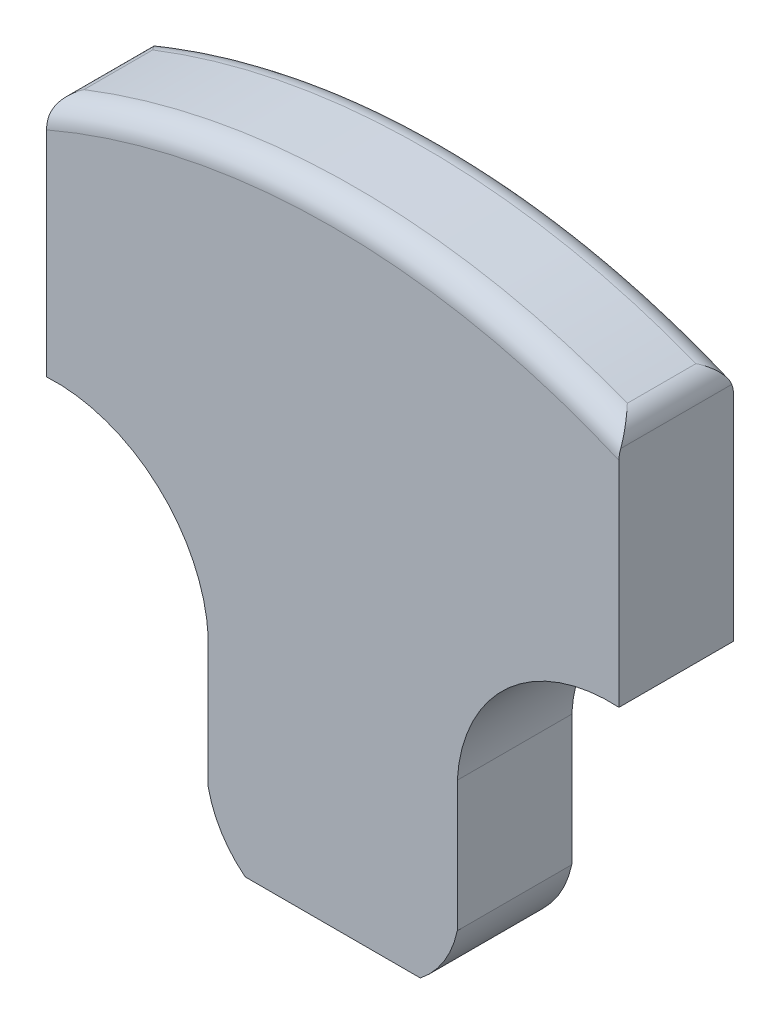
ISO-10303-21;
HEADER;
FILE_DESCRIPTION(('STEP AP214'),'2;1');
FILE_NAME('part.step','',(''),(''),'','','');
FILE_SCHEMA(('AUTOMOTIVE_DESIGN { 1 0 10303 214 1 1 1 1 }'));
ENDSEC;
DATA;
#1=APPLICATION_CONTEXT('core data for automotive mechanical design processes');
#2=APPLICATION_PROTOCOL_DEFINITION('international standard','automotive_design',2000,#1);
#3=PRODUCT_CONTEXT('',#1,'mechanical');
#4=PRODUCT('Part','Part','',(#3));
#5=PRODUCT_RELATED_PRODUCT_CATEGORY('part','',(#4));
#6=PRODUCT_DEFINITION_FORMATION('','',#4);
#7=PRODUCT_DEFINITION_CONTEXT('part definition',#1,'design');
#8=PRODUCT_DEFINITION('design','',#6,#7);
#9=PRODUCT_DEFINITION_SHAPE('','',#8);
#10=(LENGTH_UNIT() NAMED_UNIT(*) SI_UNIT(.MILLI.,.METRE.));
#11=(NAMED_UNIT(*) PLANE_ANGLE_UNIT() SI_UNIT($,.RADIAN.));
#12=(NAMED_UNIT(*) SI_UNIT($,.STERADIAN.) SOLID_ANGLE_UNIT());
#13=UNCERTAINTY_MEASURE_WITH_UNIT(LENGTH_MEASURE(1.E-05),#10,'distance_accuracy_value','');
#14=(GEOMETRIC_REPRESENTATION_CONTEXT(3) GLOBAL_UNCERTAINTY_ASSIGNED_CONTEXT((#13)) GLOBAL_UNIT_ASSIGNED_CONTEXT((#10,
#11,#12)) REPRESENTATION_CONTEXT('',''));
#15=CARTESIAN_POINT('',(0.,0.,0.));
#16=DIRECTION('',(0.,0.,1.));
#17=DIRECTION('',(1.,0.,0.));
#18=AXIS2_PLACEMENT_3D('',#15,#16,#17);
#19=CARTESIAN_POINT('',(-39.8872036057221,30.7547619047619,12.7));
#20=DIRECTION('',(1.,0.,0.));
#21=DIRECTION('',(0.,1.,0.));
#22=AXIS2_PLACEMENT_3D('',#19,#20,#21);
#23=PLANE('',#22);
#24=DIRECTION('',(0.,0.,1.));
#25=VECTOR('',#24,1.);
#26=CARTESIAN_POINT('',(-39.8872036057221,4.27019014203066,-0.190028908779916));
#27=LINE('',#26,#25);
#28=CARTESIAN_POINT('',(-39.8872036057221,4.27019014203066,0.));
#29=VERTEX_POINT('',#28);
#30=CARTESIAN_POINT('',(-39.8872036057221,4.27019014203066,12.7));
#31=VERTEX_POINT('',#30);
#32=EDGE_CURVE('E289',#29,#31,#27,.T.);
#33=ORIENTED_EDGE('',*,*,#32,.T.);
#34=DIRECTION('',(0.,-1.,0.));
#35=VECTOR('',#34,1.);
#36=CARTESIAN_POINT('',(-39.8872036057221,30.7547619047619,12.7));
#37=LINE('',#36,#35);
#38=CARTESIAN_POINT('',(-39.8872036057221,27.9974671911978,12.7));
#39=VERTEX_POINT('',#38);
#40=EDGE_CURVE('E159',#39,#31,#37,.T.);
#41=ORIENTED_EDGE('',*,*,#40,.F.);
#42=CARTESIAN_POINT('',(-39.8872036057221,27.9974671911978,12.7));
#43=CARTESIAN_POINT('',(-39.8872036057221,28.0864951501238,12.7000048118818));
#44=CARTESIAN_POINT('',(-39.8872036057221,28.1755255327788,12.6960502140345));
#45=CARTESIAN_POINT('',(-39.8872036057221,28.3521765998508,12.6803077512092));
#46=CARTESIAN_POINT('',(-39.8872036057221,28.4398028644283,12.6685824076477));
#47=CARTESIAN_POINT('',(-39.8872036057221,28.6136739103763,12.6373819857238));
#48=CARTESIAN_POINT('',(-39.8872036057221,28.6999186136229,12.6179064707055));
#49=CARTESIAN_POINT('',(-39.8872036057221,28.8709889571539,12.5710930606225));
#50=CARTESIAN_POINT('',(-39.8872036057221,28.9557976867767,12.5436934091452));
#51=CARTESIAN_POINT('',(-39.8872036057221,29.0391723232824,12.5124322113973));
#52=B_SPLINE_CURVE_WITH_KNOTS('',3,(#42,#43,#44,#45,#46,#47,#48,#49,#50,#51),.UNSPECIFIED.,.F.,
.F.,(4,2,2,2,4),(0.,0.266999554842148,0.531876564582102,0.796768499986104,1.06378321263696),.UNSPECIFIED.);
#53=CARTESIAN_POINT('',(-39.8872036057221,29.0391723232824,12.5124322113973));
#54=VERTEX_POINT('',#53);
#55=EDGE_CURVE('E154',#39,#54,#52,.T.);
#56=ORIENTED_EDGE('',*,*,#55,.T.);
#57=DIRECTION('',(0.,0.,-1.));
#58=VECTOR('',#57,1.);
#59=CARTESIAN_POINT('',(-39.8872036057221,29.0391723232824,12.7));
#60=LINE('',#59,#58);
#61=CARTESIAN_POINT('',(-39.8872036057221,29.0391723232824,0.187567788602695));
#62=VERTEX_POINT('',#61);
#63=EDGE_CURVE('E157',#54,#62,#60,.T.);
#64=ORIENTED_EDGE('',*,*,#63,.T.);
#65=CARTESIAN_POINT('',(-39.8872036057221,29.0391723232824,0.187567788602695));
#66=CARTESIAN_POINT('',(-39.8872036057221,28.9557976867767,0.156306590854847));
#67=CARTESIAN_POINT('',(-39.8872036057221,28.8709889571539,0.128906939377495));
#68=CARTESIAN_POINT('',(-39.8872036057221,28.6999186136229,0.0820935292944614));
#69=CARTESIAN_POINT('',(-39.8872036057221,28.6136739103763,0.062618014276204));
#70=CARTESIAN_POINT('',(-39.8872036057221,28.4398028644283,0.0314175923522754));
#71=CARTESIAN_POINT('',(-39.8872036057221,28.3521765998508,0.0196922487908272));
#72=CARTESIAN_POINT('',(-39.8872036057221,28.1755255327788,0.00394978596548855));
#73=CARTESIAN_POINT('',(-39.8872036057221,28.0864951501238,-4.81188178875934E-06));
#74=CARTESIAN_POINT('',(-39.8872036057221,27.9974671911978,0.));
#75=B_SPLINE_CURVE_WITH_KNOTS('',3,(#65,#66,#67,#68,#69,#70,#71,#72,#73,#74),.UNSPECIFIED.,.F.,
.F.,(4,2,2,2,4),(0.,0.26701471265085,0.531906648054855,0.796783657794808,1.06378321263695),.UNSPECIFIED.);
#76=CARTESIAN_POINT('',(-39.8872036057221,27.9974671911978,0.));
#77=VERTEX_POINT('',#76);
#78=EDGE_CURVE('E179',#62,#77,#75,.T.);
#79=ORIENTED_EDGE('',*,*,#78,.T.);
#80=DIRECTION('',(0.,-1.,0.));
#81=VECTOR('',#80,1.);
#82=CARTESIAN_POINT('',(-39.8872036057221,30.7547619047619,0.));
#83=LINE('',#82,#81);
#84=EDGE_CURVE('E305',#77,#29,#83,.T.);
#85=ORIENTED_EDGE('',*,*,#84,.T.);
#86=EDGE_LOOP('',(#33,#41,#56,#64,#79,#85));
#87=FACE_BOUND('',#86,.T.);
#88=ADVANCED_FACE('F32',(#87),#23,.F.);
#89=CARTESIAN_POINT('',(-39.8872036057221,-32.7452380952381,12.7));
#90=DIRECTION('',(0.,1.,0.));
#91=DIRECTION('',(0.,0.,1.));
#92=AXIS2_PLACEMENT_3D('',#89,#90,#91);
#93=PLANE('',#92);
#94=DIRECTION('',(1.,0.,0.));
#95=VECTOR('',#94,1.);
#96=CARTESIAN_POINT('',(-39.8872036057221,-32.7452380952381,0.));
#97=LINE('',#96,#95);
#98=CARTESIAN_POINT('',(-17.8482910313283,-32.7452380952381,0.));
#99=VERTEX_POINT('',#98);
#100=CARTESIAN_POINT('',(1.57388381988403,-32.7452380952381,0.));
#101=VERTEX_POINT('',#100);
#102=EDGE_CURVE('E309',#99,#101,#97,.T.);
#103=ORIENTED_EDGE('',*,*,#102,.T.);
#104=DIRECTION('',(0.,0.,1.));
#105=VECTOR('',#104,1.);
#106=CARTESIAN_POINT('',(1.57388381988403,-32.7452380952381,-0.190028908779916));
#107=LINE('',#106,#105);
#108=CARTESIAN_POINT('',(1.57388381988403,-32.7452380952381,12.7));
#109=VERTEX_POINT('',#108);
#110=EDGE_CURVE('E272',#101,#109,#107,.T.);
#111=ORIENTED_EDGE('',*,*,#110,.T.);
#112=DIRECTION('',(1.,0.,0.));
#113=VECTOR('',#112,1.);
#114=CARTESIAN_POINT('',(-39.8872036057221,-32.7452380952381,12.7));
#115=LINE('',#114,#113);
#116=CARTESIAN_POINT('',(-17.8482910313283,-32.7452380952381,12.7));
#117=VERTEX_POINT('',#116);
#118=EDGE_CURVE('E155',#117,#109,#115,.T.);
#119=ORIENTED_EDGE('',*,*,#118,.F.);
#120=DIRECTION('',(0.,0.,1.));
#121=VECTOR('',#120,1.);
#122=CARTESIAN_POINT('',(-17.8482910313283,-32.7452380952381,-0.190028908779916));
#123=LINE('',#122,#121);
#124=EDGE_CURVE('E287',#99,#117,#123,.T.);
#125=ORIENTED_EDGE('',*,*,#124,.F.);
#126=EDGE_LOOP('',(#103,#111,#119,#125));
#127=FACE_BOUND('',#126,.T.);
#128=ADVANCED_FACE('F175',(#127),#93,.F.);
#129=CARTESIAN_POINT('',(-8.13720360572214,-45.8013678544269,12.7));
#130=DIRECTION('',(0.,0.,-1.));
#131=DIRECTION('',(-1.,0.,0.));
#132=AXIS2_PLACEMENT_3D('',#129,#130,#131);
#133=PLANE('',#132);
#134=ORIENTED_EDGE('',*,*,#118,.T.);
#135=CARTESIAN_POINT('',(-5.4005173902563,-23.834333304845,12.7));
#136=DIRECTION('',(0.,0.,1.));
#137=DIRECTION('',(1.,0.,0.));
#138=AXIS2_PLACEMENT_3D('',#135,#136,#137);
#139=CIRCLE('',#138,11.3157631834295);
#140=CARTESIAN_POINT('',(5.67412073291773,-26.1578837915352,12.7));
#141=VERTEX_POINT('',#140);
#142=EDGE_CURVE('E268',#141,#109,#139,.F.);
#143=ORIENTED_EDGE('',*,*,#142,.F.);
#144=DIRECTION('',(0.,-1.,0.));
#145=VECTOR('',#144,1.);
#146=CARTESIAN_POINT('',(5.67412073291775,-71.205876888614,12.7));
#147=LINE('',#146,#145);
#148=CARTESIAN_POINT('',(5.67412073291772,-11.6991536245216,12.7));
#149=VERTEX_POINT('',#148);
#150=EDGE_CURVE('E148',#149,#141,#147,.T.);
#151=ORIENTED_EDGE('',*,*,#150,.F.);
#152=CARTESIAN_POINT('',(22.628130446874,-12.6838195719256,12.7));
#153=DIRECTION('',(0.,0.,1.));
#154=DIRECTION('',(1.,0.,0.));
#155=AXIS2_PLACEMENT_3D('',#152,#153,#154);
#156=CIRCLE('',#155,16.9825796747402);
#157=CARTESIAN_POINT('',(23.6127963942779,4.27019014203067,12.7));
#158=VERTEX_POINT('',#157);
#159=EDGE_CURVE('E134',#158,#149,#156,.T.);
#160=ORIENTED_EDGE('',*,*,#159,.F.);
#161=DIRECTION('',(0.,1.,0.));
#162=VECTOR('',#161,1.);
#163=CARTESIAN_POINT('',(23.6127963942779,30.7547619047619,12.7));
#164=LINE('',#163,#162);
#165=CARTESIAN_POINT('',(23.6127963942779,27.9974671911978,12.7));
#166=VERTEX_POINT('',#165);
#167=EDGE_CURVE('E144',#158,#166,#164,.T.);
#168=ORIENTED_EDGE('',*,*,#167,.T.);
#169=CARTESIAN_POINT('',(-8.13720360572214,-45.8013678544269,12.7));
#170=DIRECTION('',(0.,0.,-1.));
#171=DIRECTION('',(-1.,0.,0.));
#172=AXIS2_PLACEMENT_3D('',#169,#170,#171);
#173=CIRCLE('',#172,80.3388483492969);
#174=EDGE_CURVE('E252',#166,#39,#173,.F.);
#175=ORIENTED_EDGE('',*,*,#174,.T.);
#176=ORIENTED_EDGE('',*,*,#40,.T.);
#177=CARTESIAN_POINT('',(-38.9025376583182,-12.6838195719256,12.7));
#178=DIRECTION('',(0.,0.,1.));
#179=DIRECTION('',(1.,0.,0.));
#180=AXIS2_PLACEMENT_3D('',#177,#178,#179);
#181=CIRCLE('',#180,16.9825796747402);
#182=CARTESIAN_POINT('',(-21.948527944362,-11.6991536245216,12.7));
#183=VERTEX_POINT('',#182);
#184=EDGE_CURVE('E283',#31,#183,#181,.F.);
#185=ORIENTED_EDGE('',*,*,#184,.T.);
#186=DIRECTION('',(0.,-1.,0.));
#187=VECTOR('',#186,1.);
#188=CARTESIAN_POINT('',(-21.948527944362,-71.205876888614,12.7));
#189=LINE('',#188,#187);
#190=CARTESIAN_POINT('',(-21.948527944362,-26.1578837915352,12.7));
#191=VERTEX_POINT('',#190);
#192=EDGE_CURVE('E275',#183,#191,#189,.T.);
#193=ORIENTED_EDGE('',*,*,#192,.T.);
#194=CARTESIAN_POINT('',(-10.8738898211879,-23.834333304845,12.7));
#195=DIRECTION('',(0.,0.,1.));
#196=DIRECTION('',(1.,0.,0.));
#197=AXIS2_PLACEMENT_3D('',#194,#195,#196);
#198=CIRCLE('',#197,11.3157631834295);
#199=EDGE_CURVE('E271',#191,#117,#198,.T.);
#200=ORIENTED_EDGE('',*,*,#199,.T.);
#201=EDGE_LOOP('',(#134,#143,#151,#160,#168,#175,#176,#185,#193,#200));
#202=FACE_BOUND('',#201,.T.);
#203=ADVANCED_FACE('F143',(#202),#133,.F.);
#204=CARTESIAN_POINT('',(-8.13720360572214,-45.8013678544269,0.));
#205=DIRECTION('',(0.,0.,-1.));
#206=DIRECTION('',(-1.,0.,0.));
#207=AXIS2_PLACEMENT_3D('',#204,#205,#206);
#208=PLANE('',#207);
#209=CARTESIAN_POINT('',(-5.4005173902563,-23.834333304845,0.));
#210=DIRECTION('',(0.,0.,-1.));
#211=DIRECTION('',(-1.,0.,0.));
#212=AXIS2_PLACEMENT_3D('',#209,#210,#211);
#213=CIRCLE('',#212,11.3157631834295);
#214=CARTESIAN_POINT('',(5.67412073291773,-26.1578837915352,0.));
#215=VERTEX_POINT('',#214);
#216=EDGE_CURVE('E11',#101,#215,#213,.F.);
#217=ORIENTED_EDGE('',*,*,#216,.F.);
#218=ORIENTED_EDGE('',*,*,#102,.F.);
#219=CARTESIAN_POINT('',(-10.8738898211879,-23.834333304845,0.));
#220=DIRECTION('',(0.,0.,-1.));
#221=DIRECTION('',(-1.,0.,0.));
#222=AXIS2_PLACEMENT_3D('',#219,#220,#221);
#223=CIRCLE('',#222,11.3157631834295);
#224=CARTESIAN_POINT('',(-21.948527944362,-26.1578837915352,0.));
#225=VERTEX_POINT('',#224);
#226=EDGE_CURVE('E139',#99,#225,#223,.T.);
#227=ORIENTED_EDGE('',*,*,#226,.T.);
#228=DIRECTION('',(0.,1.,0.));
#229=VECTOR('',#228,1.);
#230=CARTESIAN_POINT('',(-21.948527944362,-45.8013678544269,0.));
#231=LINE('',#230,#229);
#232=CARTESIAN_POINT('',(-21.948527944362,-11.6991536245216,0.));
#233=VERTEX_POINT('',#232);
#234=EDGE_CURVE('E254',#225,#233,#231,.T.);
#235=ORIENTED_EDGE('',*,*,#234,.T.);
#236=CARTESIAN_POINT('',(-38.9025376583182,-12.6838195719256,0.));
#237=DIRECTION('',(0.,0.,-1.));
#238=DIRECTION('',(-1.,0.,0.));
#239=AXIS2_PLACEMENT_3D('',#236,#237,#238);
#240=CIRCLE('',#239,16.9825796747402);
#241=EDGE_CURVE('E257',#233,#29,#240,.F.);
#242=ORIENTED_EDGE('',*,*,#241,.T.);
#243=ORIENTED_EDGE('',*,*,#84,.F.);
#244=CARTESIAN_POINT('',(-8.13720360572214,-45.8013678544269,0.));
#245=DIRECTION('',(0.,0.,-1.));
#246=DIRECTION('',(-1.,0.,0.));
#247=AXIS2_PLACEMENT_3D('',#244,#245,#246);
#248=CIRCLE('',#247,80.3388483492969);
#249=CARTESIAN_POINT('',(23.6127963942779,27.9974671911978,0.));
#250=VERTEX_POINT('',#249);
#251=EDGE_CURVE('E248',#77,#250,#248,.T.);
#252=ORIENTED_EDGE('',*,*,#251,.T.);
#253=DIRECTION('',(0.,1.,0.));
#254=VECTOR('',#253,1.);
#255=CARTESIAN_POINT('',(23.6127963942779,30.7547619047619,0.));
#256=LINE('',#255,#254);
#257=CARTESIAN_POINT('',(23.6127963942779,4.27019014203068,0.));
#258=VERTEX_POINT('',#257);
#259=EDGE_CURVE('E270',#258,#250,#256,.T.);
#260=ORIENTED_EDGE('',*,*,#259,.F.);
#261=CARTESIAN_POINT('',(22.628130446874,-12.6838195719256,0.));
#262=DIRECTION('',(0.,0.,-1.));
#263=DIRECTION('',(-1.,0.,0.));
#264=AXIS2_PLACEMENT_3D('',#261,#262,#263);
#265=CIRCLE('',#264,16.9825796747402);
#266=CARTESIAN_POINT('',(5.67412073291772,-11.6991536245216,0.));
#267=VERTEX_POINT('',#266);
#268=EDGE_CURVE('E47',#267,#258,#265,.T.);
#269=ORIENTED_EDGE('',*,*,#268,.F.);
#270=DIRECTION('',(0.,1.,0.));
#271=VECTOR('',#270,1.);
#272=CARTESIAN_POINT('',(5.67412073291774,-45.8013678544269,0.));
#273=LINE('',#272,#271);
#274=EDGE_CURVE('E40',#215,#267,#273,.T.);
#275=ORIENTED_EDGE('',*,*,#274,.F.);
#276=EDGE_LOOP('',(#217,#218,#227,#235,#242,#243,#252,#260,#269,#275));
#277=FACE_BOUND('',#276,.T.);
#278=ADVANCED_FACE('F228',(#277),#208,.T.);
#279=CARTESIAN_POINT('',(-8.13720360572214,-45.8013678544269,12.7));
#280=DIRECTION('',(0.,0.,-1.));
#281=DIRECTION('',(-1.,0.,0.));
#282=AXIS2_PLACEMENT_3D('',#279,#280,#281);
#283=CYLINDRICAL_SURFACE('',#282,82.8788483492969);
#284=DIRECTION('',(0.,0.,-1.));
#285=VECTOR('',#284,1.);
#286=CARTESIAN_POINT('',(21.9963022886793,31.4053373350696,12.7));
#287=LINE('',#286,#285);
#288=CARTESIAN_POINT('',(21.9963022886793,31.4053373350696,10.16));
#289=VERTEX_POINT('',#288);
#290=CARTESIAN_POINT('',(21.9963022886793,31.4053373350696,2.54));
#291=VERTEX_POINT('',#290);
#292=EDGE_CURVE('E322',#289,#291,#287,.T.);
#293=ORIENTED_EDGE('',*,*,#292,.T.);
#294=CARTESIAN_POINT('',(-8.13720360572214,-45.8013678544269,2.54));
#295=DIRECTION('',(0.,0.,-1.));
#296=DIRECTION('',(-1.,0.,0.));
#297=AXIS2_PLACEMENT_3D('',#294,#295,#296);
#298=CIRCLE('',#297,82.8788483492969);
#299=CARTESIAN_POINT('',(-38.2707095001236,31.4053373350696,2.54));
#300=VERTEX_POINT('',#299);
#301=EDGE_CURVE('E319',#291,#300,#298,.F.);
#302=ORIENTED_EDGE('',*,*,#301,.T.);
#303=DIRECTION('',(0.,0.,-1.));
#304=VECTOR('',#303,1.);
#305=CARTESIAN_POINT('',(-38.2707095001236,31.4053373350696,12.7));
#306=LINE('',#305,#304);
#307=CARTESIAN_POINT('',(-38.2707095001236,31.4053373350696,10.16));
#308=VERTEX_POINT('',#307);
#309=EDGE_CURVE('E323',#300,#308,#306,.F.);
#310=ORIENTED_EDGE('',*,*,#309,.T.);
#311=CARTESIAN_POINT('',(-8.13720360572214,-45.8013678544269,10.16));
#312=DIRECTION('',(0.,0.,-1.));
#313=DIRECTION('',(-1.,0.,0.));
#314=AXIS2_PLACEMENT_3D('',#311,#312,#313);
#315=CIRCLE('',#314,82.8788483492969);
#316=EDGE_CURVE('E185',#308,#289,#315,.T.);
#317=ORIENTED_EDGE('',*,*,#316,.T.);
#318=EDGE_LOOP('',(#293,#302,#310,#317));
#319=FACE_BOUND('',#318,.T.);
#320=ADVANCED_FACE('F34',(#319),#283,.T.);
#321=CARTESIAN_POINT('',(23.6127963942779,30.7547619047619,12.7));
#322=DIRECTION('',(-1.,0.,0.));
#323=DIRECTION('',(0.,-1.,0.));
#324=AXIS2_PLACEMENT_3D('',#321,#322,#323);
#325=PLANE('',#324);
#326=ORIENTED_EDGE('',*,*,#167,.F.);
#327=DIRECTION('',(0.,0.,1.));
#328=VECTOR('',#327,1.);
#329=CARTESIAN_POINT('',(23.6127963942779,4.27019014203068,-0.190028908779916));
#330=LINE('',#329,#328);
#331=EDGE_CURVE('E131',#158,#258,#330,.F.);
#332=ORIENTED_EDGE('',*,*,#331,.T.);
#333=ORIENTED_EDGE('',*,*,#259,.T.);
#334=CARTESIAN_POINT('',(23.6127963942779,27.9974671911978,0.));
#335=CARTESIAN_POINT('',(23.6127963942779,28.0864951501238,-4.81188178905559E-06));
#336=CARTESIAN_POINT('',(23.6127963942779,28.1755255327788,0.00394978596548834));
#337=CARTESIAN_POINT('',(23.6127963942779,28.3521765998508,0.019692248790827));
#338=CARTESIAN_POINT('',(23.6127963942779,28.4398028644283,0.031417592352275));
#339=CARTESIAN_POINT('',(23.6127963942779,28.6136739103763,0.0626180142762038));
#340=CARTESIAN_POINT('',(23.6127963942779,28.6999186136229,0.0820935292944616));
#341=CARTESIAN_POINT('',(23.6127963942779,28.8709889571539,0.128906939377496));
#342=CARTESIAN_POINT('',(23.6127963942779,28.9557976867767,0.156306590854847));
#343=CARTESIAN_POINT('',(23.6127963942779,29.0391723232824,0.187567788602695));
#344=B_SPLINE_CURVE_WITH_KNOTS('',3,(#334,#335,#336,#337,#338,#339,#340,#341,#342,#343),
.UNSPECIFIED.,.F.,.F.,(4,2,2,2,4),(0.,0.266999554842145,0.531876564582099,0.796768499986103,
1.06378321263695),.UNSPECIFIED.);
#345=CARTESIAN_POINT('',(23.6127963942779,29.0391723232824,0.187567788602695));
#346=VERTEX_POINT('',#345);
#347=EDGE_CURVE('E243',#250,#346,#344,.T.);
#348=ORIENTED_EDGE('',*,*,#347,.T.);
#349=DIRECTION('',(0.,0.,-1.));
#350=VECTOR('',#349,1.);
#351=CARTESIAN_POINT('',(23.6127963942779,29.0391723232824,12.7));
#352=LINE('',#351,#350);
#353=CARTESIAN_POINT('',(23.6127963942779,29.0391723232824,12.5124322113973));
#354=VERTEX_POINT('',#353);
#355=EDGE_CURVE('E249',#346,#354,#352,.F.);
#356=ORIENTED_EDGE('',*,*,#355,.T.);
#357=CARTESIAN_POINT('',(23.6127963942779,29.0391723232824,12.5124322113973));
#358=CARTESIAN_POINT('',(23.6127963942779,28.9557976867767,12.5436934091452));
#359=CARTESIAN_POINT('',(23.6127963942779,28.8709889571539,12.5710930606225));
#360=CARTESIAN_POINT('',(23.6127963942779,28.6999186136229,12.6179064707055));
#361=CARTESIAN_POINT('',(23.6127963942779,28.6136739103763,12.6373819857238));
#362=CARTESIAN_POINT('',(23.6127963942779,28.4398028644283,12.6685824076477));
#363=CARTESIAN_POINT('',(23.6127963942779,28.3521765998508,12.6803077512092));
#364=CARTESIAN_POINT('',(23.6127963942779,28.1755255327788,12.6960502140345));
#365=CARTESIAN_POINT('',(23.6127963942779,28.0864951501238,12.7000048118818));
#366=CARTESIAN_POINT('',(23.6127963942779,27.9974671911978,12.7));
#367=B_SPLINE_CURVE_WITH_KNOTS('',3,(#357,#358,#359,#360,#361,#362,#363,#364,#365,#366),
.UNSPECIFIED.,.F.,.F.,(4,2,2,2,4),(0.,0.267014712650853,0.531906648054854,0.796783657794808,
1.06378321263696),.UNSPECIFIED.);
#368=EDGE_CURVE('E152',#354,#166,#367,.T.);
#369=ORIENTED_EDGE('',*,*,#368,.T.);
#370=EDGE_LOOP('',(#326,#332,#333,#348,#356,#369));
#371=FACE_BOUND('',#370,.T.);
#372=ADVANCED_FACE('F150',(#371),#325,.F.);
#373=CARTESIAN_POINT('',(21.0727963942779,29.0391723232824,12.7));
#374=DIRECTION('',(0.,0.,-1.));
#375=DIRECTION('',(-1.,0.,0.));
#376=AXIS2_PLACEMENT_3D('',#373,#374,#375);
#377=CYLINDRICAL_SURFACE('',#376,2.54);
#378=CARTESIAN_POINT('',(23.6127963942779,29.0391723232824,0.187567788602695));
#379=CARTESIAN_POINT('',(23.6127965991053,29.112229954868,0.214955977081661));
#380=CARTESIAN_POINT('',(23.6096451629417,29.1842574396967,0.244823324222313));
#381=CARTESIAN_POINT('',(23.5975760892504,29.3257321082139,0.308822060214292));
#382=CARTESIAN_POINT('',(23.588669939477,29.3951841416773,0.342944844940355));
#383=CARTESIAN_POINT('',(23.5543538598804,29.5978402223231,0.450051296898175));
#384=CARTESIAN_POINT('',(23.5213219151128,29.7269567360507,0.528400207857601));
#385=CARTESIAN_POINT('',(23.4273631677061,30.0060752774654,0.71813900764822));
#386=CARTESIAN_POINT('',(23.3612735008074,30.152108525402,0.832700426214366));
#387=CARTESIAN_POINT('',(23.2080696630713,30.4236014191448,1.07309533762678));
#388=CARTESIAN_POINT('',(23.1208343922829,30.5489353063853,1.1989910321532));
#389=CARTESIAN_POINT('',(22.9628310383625,30.7388653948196,1.41316447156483));
#390=CARTESIAN_POINT('',(22.8966622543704,30.8095582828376,1.49955119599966));
#391=CARTESIAN_POINT('',(22.7582524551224,30.9418041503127,1.67444967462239));
#392=CARTESIAN_POINT('',(22.6860090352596,31.0033534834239,1.76296226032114));
#393=CARTESIAN_POINT('',(22.4618304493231,31.173972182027,2.03012163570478));
#394=CARTESIAN_POINT('',(22.3019581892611,31.2695836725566,2.21104597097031));
#395=CARTESIAN_POINT('',(22.0912234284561,31.3665479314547,2.43905506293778));
#396=CARTESIAN_POINT('',(22.0474062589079,31.3852335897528,2.4859321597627));
#397=CARTESIAN_POINT('',(22.0008317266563,31.4035657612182,2.53521154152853));
#398=CARTESIAN_POINT('',(21.9985676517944,31.4044531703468,2.53760576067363));
#399=CARTESIAN_POINT('',(21.9963022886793,31.4053373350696,2.54));
#400=B_SPLINE_CURVE_WITH_KNOTS('',3,(#378,#379,#380,#381,#382,#383,#384,#385,#386,#387,#388,
#389,#390,#391,#392,#393,#394,#395,#396,#397,#398,#399),.UNSPECIFIED.,.F.,.F.,(4,2,2,2,2,2,2,2,
2,2,4),(0.,0.233808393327,0.467151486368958,0.928727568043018,1.51675567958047,2.10823445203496,
2.49704885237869,2.88601789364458,3.66099677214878,3.86148167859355,3.87171946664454),.UNSPECIFIED.);
#401=EDGE_CURVE('E208',#291,#346,#400,.F.);
#402=ORIENTED_EDGE('',*,*,#401,.F.);
#403=ORIENTED_EDGE('',*,*,#292,.F.);
#404=CARTESIAN_POINT('',(23.6127963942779,29.0391723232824,12.5124322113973));
#405=CARTESIAN_POINT('',(23.6127965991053,29.112229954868,12.4850440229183));
#406=CARTESIAN_POINT('',(23.6096451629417,29.1842574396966,12.4551766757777));
#407=CARTESIAN_POINT('',(23.5975760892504,29.3257321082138,12.3911779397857));
#408=CARTESIAN_POINT('',(23.588669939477,29.3951841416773,12.3570551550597));
#409=CARTESIAN_POINT('',(23.5543538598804,29.5978402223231,12.2499487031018));
#410=CARTESIAN_POINT('',(23.5213219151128,29.7269567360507,12.1715997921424));
#411=CARTESIAN_POINT('',(23.4273631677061,30.0060752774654,11.9818609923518));
#412=CARTESIAN_POINT('',(23.3612735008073,30.1521085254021,11.8672995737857));
#413=CARTESIAN_POINT('',(23.2080696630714,30.4236014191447,11.6269046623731));
#414=CARTESIAN_POINT('',(23.1208343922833,30.5489353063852,11.5010089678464));
#415=CARTESIAN_POINT('',(22.9628310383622,30.7388653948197,11.2868355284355));
#416=CARTESIAN_POINT('',(22.8966622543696,30.8095582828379,11.2004488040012));
#417=CARTESIAN_POINT('',(22.7582524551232,30.9418041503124,11.0255503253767));
#418=CARTESIAN_POINT('',(22.6860090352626,31.0033534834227,10.9370377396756));
#419=CARTESIAN_POINT('',(22.4618304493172,31.1739721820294,10.6698783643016));
#420=CARTESIAN_POINT('',(22.3019581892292,31.2695836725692,10.4889540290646));
#421=CARTESIAN_POINT('',(22.0912234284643,31.3665479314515,10.2609449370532));
#422=CARTESIAN_POINT('',(22.0474062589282,31.3852335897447,10.214067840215));
#423=CARTESIAN_POINT('',(22.0008317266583,31.4035657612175,10.1647884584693));
#424=CARTESIAN_POINT('',(21.9985676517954,31.4044531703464,10.1623942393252));
#425=CARTESIAN_POINT('',(21.9963022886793,31.4053373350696,10.16));
#426=B_SPLINE_CURVE_WITH_KNOTS('',3,(#404,#405,#406,#407,#408,#409,#410,#411,#412,#413,#414,
#415,#416,#417,#418,#419,#420,#421,#422,#423,#424,#425),.UNSPECIFIED.,.F.,.F.,(4,2,2,2,2,2,2,2,
2,2,4),(0.,0.233808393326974,0.467151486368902,0.928727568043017,1.51675567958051,
2.10823445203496,2.49704885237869,2.88601789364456,3.66099677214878,3.86148167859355,
3.87171946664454),.UNSPECIFIED.);
#427=EDGE_CURVE('E214',#354,#289,#426,.T.);
#428=ORIENTED_EDGE('',*,*,#427,.F.);
#429=ORIENTED_EDGE('',*,*,#355,.F.);
#430=EDGE_LOOP('',(#402,#403,#428,#429));
#431=FACE_BOUND('',#430,.T.);
#432=ADVANCED_FACE('F223',(#431),#377,.T.);
#433=CARTESIAN_POINT('',(-8.13720360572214,-45.8013678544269,10.16));
#434=DIRECTION('',(0.,0.,-1.));
#435=DIRECTION('',(-1.,0.,0.));
#436=AXIS2_PLACEMENT_3D('',#433,#434,#435);
#437=TOROIDAL_SURFACE('',#436,80.3388483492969,2.54);
#438=ORIENTED_EDGE('',*,*,#427,.T.);
#439=ORIENTED_EDGE('',*,*,#316,.F.);
#440=CARTESIAN_POINT('',(-39.8872036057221,29.0391723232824,12.5124322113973));
#441=CARTESIAN_POINT('',(-39.8872038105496,29.112229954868,12.4850440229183));
#442=CARTESIAN_POINT('',(-39.8840523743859,29.1842574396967,12.4551766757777));
#443=CARTESIAN_POINT('',(-39.8719833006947,29.3257321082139,12.3911779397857));
#444=CARTESIAN_POINT('',(-39.8630771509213,29.3951841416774,12.3570551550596));
#445=CARTESIAN_POINT('',(-39.8287610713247,29.5978402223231,12.2499487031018));
#446=CARTESIAN_POINT('',(-39.7957291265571,29.7269567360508,12.1715997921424));
#447=CARTESIAN_POINT('',(-39.7017703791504,30.0060752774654,11.9818609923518));
#448=CARTESIAN_POINT('',(-39.6356807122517,30.152108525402,11.8672995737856));
#449=CARTESIAN_POINT('',(-39.4824768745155,30.4236014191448,11.6269046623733));
#450=CARTESIAN_POINT('',(-39.3952416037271,30.5489353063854,11.501008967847));
#451=CARTESIAN_POINT('',(-39.2372382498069,30.7388653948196,11.2868355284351));
#452=CARTESIAN_POINT('',(-39.171069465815,30.8095582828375,11.200448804));
#453=CARTESIAN_POINT('',(-39.0326596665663,30.9418041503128,11.025550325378));
#454=CARTESIAN_POINT('',(-38.9604162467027,31.0033534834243,10.9370377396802));
#455=CARTESIAN_POINT('',(-38.7362376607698,31.1739721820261,10.6698783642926));
#456=CARTESIAN_POINT('',(-38.5763654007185,31.2695836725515,10.4889540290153));
#457=CARTESIAN_POINT('',(-38.3656306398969,31.3665479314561,10.260944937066));
#458=CARTESIAN_POINT('',(-38.3218134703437,31.3852335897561,10.2140678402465));
#459=CARTESIAN_POINT('',(-38.2752389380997,31.4035657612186,10.1647884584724));
#460=CARTESIAN_POINT('',(-38.2729748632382,31.404453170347,10.1623942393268));
#461=CARTESIAN_POINT('',(-38.2707095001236,31.4053373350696,10.16));
#462=B_SPLINE_CURVE_WITH_KNOTS('',3,(#440,#441,#442,#443,#444,#445,#446,#447,#448,#449,#450,
#451,#452,#453,#454,#455,#456,#457,#458,#459,#460,#461),.UNSPECIFIED.,.F.,.F.,(4,2,2,2,2,2,2,2,
2,2,4),(0.,0.233808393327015,0.467151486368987,0.928727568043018,1.51675567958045,
2.10823445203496,2.4970488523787,2.88601789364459,3.66099677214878,3.86148167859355,
3.87171946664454),.UNSPECIFIED.);
#463=EDGE_CURVE('E215',#54,#308,#462,.T.);
#464=ORIENTED_EDGE('',*,*,#463,.F.);
#465=ORIENTED_EDGE('',*,*,#55,.F.);
#466=ORIENTED_EDGE('',*,*,#174,.F.);
#467=ORIENTED_EDGE('',*,*,#368,.F.);
#468=EDGE_LOOP('',(#438,#439,#464,#465,#466,#467));
#469=FACE_BOUND('',#468,.T.);
#470=ADVANCED_FACE('F168',(#469),#437,.T.);
#471=CARTESIAN_POINT('',(-8.13720360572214,-45.8013678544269,2.54));
#472=DIRECTION('',(0.,0.,-1.));
#473=DIRECTION('',(-1.,0.,0.));
#474=AXIS2_PLACEMENT_3D('',#471,#472,#473);
#475=TOROIDAL_SURFACE('',#474,80.3388483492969,2.54);
#476=ORIENTED_EDGE('',*,*,#251,.F.);
#477=ORIENTED_EDGE('',*,*,#78,.F.);
#478=CARTESIAN_POINT('',(-39.8872036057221,29.0391723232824,0.187567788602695));
#479=CARTESIAN_POINT('',(-39.8872038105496,29.112229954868,0.214955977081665));
#480=CARTESIAN_POINT('',(-39.8840523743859,29.1842574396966,0.244823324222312));
#481=CARTESIAN_POINT('',(-39.8719833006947,29.3257321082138,0.308822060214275));
#482=CARTESIAN_POINT('',(-39.8630771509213,29.3951841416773,0.342944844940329));
#483=CARTESIAN_POINT('',(-39.8287610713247,29.5978402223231,0.450051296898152));
#484=CARTESIAN_POINT('',(-39.7957291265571,29.7269567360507,0.528400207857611));
#485=CARTESIAN_POINT('',(-39.7017703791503,30.0060752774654,0.718139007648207));
#486=CARTESIAN_POINT('',(-39.6356807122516,30.1521085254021,0.832700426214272));
#487=CARTESIAN_POINT('',(-39.4824768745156,30.4236014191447,1.07309533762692));
#488=CARTESIAN_POINT('',(-39.3952416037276,30.5489353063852,1.19899103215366));
#489=CARTESIAN_POINT('',(-39.2372382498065,30.7388653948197,1.41316447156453));
#490=CARTESIAN_POINT('',(-39.1710694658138,30.809558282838,1.49955119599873));
#491=CARTESIAN_POINT('',(-39.0326596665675,30.9418041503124,1.67444967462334));
#492=CARTESIAN_POINT('',(-38.9604162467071,31.0033534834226,1.76296226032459));
#493=CARTESIAN_POINT('',(-38.7362376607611,31.1739721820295,2.03012163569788));
#494=CARTESIAN_POINT('',(-38.5763654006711,31.2695836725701,2.21104597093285));
#495=CARTESIAN_POINT('',(-38.3656306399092,31.3665479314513,2.43905506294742));
#496=CARTESIAN_POINT('',(-38.321813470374,31.3852335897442,2.48593215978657));
#497=CARTESIAN_POINT('',(-38.2752389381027,31.4035657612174,2.5352115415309));
#498=CARTESIAN_POINT('',(-38.2729748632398,31.4044531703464,2.53760576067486));
#499=CARTESIAN_POINT('',(-38.2707095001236,31.4053373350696,2.54));
#500=B_SPLINE_CURVE_WITH_KNOTS('',3,(#478,#479,#480,#481,#482,#483,#484,#485,#486,#487,#488,
#489,#490,#491,#492,#493,#494,#495,#496,#497,#498,#499),.UNSPECIFIED.,.F.,.F.,(4,2,2,2,2,2,2,2,
2,2,4),(0.,0.233808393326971,0.467151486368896,0.928727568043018,1.51675567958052,
2.10823445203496,2.49704885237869,2.88601789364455,3.66099677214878,3.86148167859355,
3.87171946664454),.UNSPECIFIED.);
#501=EDGE_CURVE('E199',#300,#62,#500,.F.);
#502=ORIENTED_EDGE('',*,*,#501,.F.);
#503=ORIENTED_EDGE('',*,*,#301,.F.);
#504=ORIENTED_EDGE('',*,*,#401,.T.);
#505=ORIENTED_EDGE('',*,*,#347,.F.);
#506=EDGE_LOOP('',(#476,#477,#502,#503,#504,#505));
#507=FACE_BOUND('',#506,.T.);
#508=ADVANCED_FACE('F187',(#507),#475,.T.);
#509=CARTESIAN_POINT('',(-37.3472036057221,29.0391723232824,12.7));
#510=DIRECTION('',(0.,0.,-1.));
#511=DIRECTION('',(-1.,0.,0.));
#512=AXIS2_PLACEMENT_3D('',#509,#510,#511);
#513=CYLINDRICAL_SURFACE('',#512,2.54);
#514=ORIENTED_EDGE('',*,*,#463,.T.);
#515=ORIENTED_EDGE('',*,*,#309,.F.);
#516=ORIENTED_EDGE('',*,*,#501,.T.);
#517=ORIENTED_EDGE('',*,*,#63,.F.);
#518=EDGE_LOOP('',(#514,#515,#516,#517));
#519=FACE_BOUND('',#518,.T.);
#520=ADVANCED_FACE('F191',(#519),#513,.T.);
#521=CARTESIAN_POINT('',(-10.8738898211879,-23.834333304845,-0.190028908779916));
#522=DIRECTION('',(0.,0.,1.));
#523=DIRECTION('',(1.,0.,0.));
#524=AXIS2_PLACEMENT_3D('',#521,#522,#523);
#525=CYLINDRICAL_SURFACE('',#524,11.3157631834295);
#526=ORIENTED_EDGE('',*,*,#124,.T.);
#527=ORIENTED_EDGE('',*,*,#199,.F.);
#528=DIRECTION('',(0.,0.,1.));
#529=VECTOR('',#528,1.);
#530=CARTESIAN_POINT('',(-21.948527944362,-26.1578837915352,-0.190028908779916));
#531=LINE('',#530,#529);
#532=EDGE_CURVE('E286',#225,#191,#531,.T.);
#533=ORIENTED_EDGE('',*,*,#532,.F.);
#534=ORIENTED_EDGE('',*,*,#226,.F.);
#535=EDGE_LOOP('',(#526,#527,#533,#534));
#536=FACE_BOUND('',#535,.T.);
#537=ADVANCED_FACE('F193',(#536),#525,.T.);
#538=CARTESIAN_POINT('',(-38.9025376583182,-12.6838195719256,-0.190028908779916));
#539=DIRECTION('',(0.,0.,1.));
#540=DIRECTION('',(1.,0.,0.));
#541=AXIS2_PLACEMENT_3D('',#538,#539,#540);
#542=CYLINDRICAL_SURFACE('',#541,16.9825796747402);
#543=DIRECTION('',(0.,0.,1.));
#544=VECTOR('',#543,1.);
#545=CARTESIAN_POINT('',(-21.948527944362,-11.6991536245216,-0.190028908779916));
#546=LINE('',#545,#544);
#547=EDGE_CURVE('E55',#233,#183,#546,.T.);
#548=ORIENTED_EDGE('',*,*,#547,.T.);
#549=ORIENTED_EDGE('',*,*,#184,.F.);
#550=ORIENTED_EDGE('',*,*,#32,.F.);
#551=ORIENTED_EDGE('',*,*,#241,.F.);
#552=EDGE_LOOP('',(#548,#549,#550,#551));
#553=FACE_BOUND('',#552,.T.);
#554=ADVANCED_FACE('F301',(#553),#542,.F.);
#555=CARTESIAN_POINT('',(-21.948527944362,-71.205876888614,-0.190028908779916));
#556=DIRECTION('',(-1.,0.,0.));
#557=DIRECTION('',(0.,0.,1.));
#558=AXIS2_PLACEMENT_3D('',#555,#556,#557);
#559=PLANE('',#558);
#560=ORIENTED_EDGE('',*,*,#532,.T.);
#561=ORIENTED_EDGE('',*,*,#192,.F.);
#562=ORIENTED_EDGE('',*,*,#547,.F.);
#563=ORIENTED_EDGE('',*,*,#234,.F.);
#564=EDGE_LOOP('',(#560,#561,#562,#563));
#565=FACE_BOUND('',#564,.T.);
#566=ADVANCED_FACE('F294',(#565),#559,.T.);
#567=CARTESIAN_POINT('',(-5.4005173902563,-23.834333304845,-0.190028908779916));
#568=DIRECTION('',(0.,0.,1.));
#569=DIRECTION('',(1.,0.,0.));
#570=AXIS2_PLACEMENT_3D('',#567,#568,#569);
#571=CYLINDRICAL_SURFACE('',#570,11.3157631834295);
#572=ORIENTED_EDGE('',*,*,#216,.T.);
#573=DIRECTION('',(0.,0.,1.));
#574=VECTOR('',#573,1.);
#575=CARTESIAN_POINT('',(5.67412073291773,-26.1578837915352,-0.190028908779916));
#576=LINE('',#575,#574);
#577=EDGE_CURVE('E266',#215,#141,#576,.T.);
#578=ORIENTED_EDGE('',*,*,#577,.T.);
#579=ORIENTED_EDGE('',*,*,#142,.T.);
#580=ORIENTED_EDGE('',*,*,#110,.F.);
#581=EDGE_LOOP('',(#572,#578,#579,#580));
#582=FACE_BOUND('',#581,.T.);
#583=ADVANCED_FACE('F344',(#582),#571,.T.);
#584=CARTESIAN_POINT('',(5.67412073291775,-71.205876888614,-0.190028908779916));
#585=DIRECTION('',(-1.,0.,0.));
#586=DIRECTION('',(0.,-1.,0.));
#587=AXIS2_PLACEMENT_3D('',#584,#585,#586);
#588=PLANE('',#587);
#589=ORIENTED_EDGE('',*,*,#274,.T.);
#590=DIRECTION('',(0.,0.,1.));
#591=VECTOR('',#590,1.);
#592=CARTESIAN_POINT('',(5.67412073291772,-11.6991536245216,-0.190028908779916));
#593=LINE('',#592,#591);
#594=EDGE_CURVE('E265',#267,#149,#593,.T.);
#595=ORIENTED_EDGE('',*,*,#594,.T.);
#596=ORIENTED_EDGE('',*,*,#150,.T.);
#597=ORIENTED_EDGE('',*,*,#577,.F.);
#598=EDGE_LOOP('',(#589,#595,#596,#597));
#599=FACE_BOUND('',#598,.T.);
#600=ADVANCED_FACE('F264',(#599),#588,.F.);
#601=CARTESIAN_POINT('',(22.628130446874,-12.6838195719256,-0.190028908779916));
#602=DIRECTION('',(0.,0.,1.));
#603=DIRECTION('',(1.,0.,0.));
#604=AXIS2_PLACEMENT_3D('',#601,#602,#603);
#605=CYLINDRICAL_SURFACE('',#604,16.9825796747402);
#606=ORIENTED_EDGE('',*,*,#268,.T.);
#607=ORIENTED_EDGE('',*,*,#331,.F.);
#608=ORIENTED_EDGE('',*,*,#159,.T.);
#609=ORIENTED_EDGE('',*,*,#594,.F.);
#610=EDGE_LOOP('',(#606,#607,#608,#609));
#611=FACE_BOUND('',#610,.T.);
#612=ADVANCED_FACE('F133',(#611),#605,.F.);
#613=CLOSED_SHELL('',(#88,#128,#203,#278,#320,#372,#432,#470,#508,#520,#537,#554,#566,#583,#600,#612));
#614=MANIFOLD_SOLID_BREP('B2',#613);
#615=ADVANCED_BREP_SHAPE_REPRESENTATION('',(#18,#614),#14);
#616=SHAPE_DEFINITION_REPRESENTATION(#9,#615);
ENDSEC;
END-ISO-10303-21;
